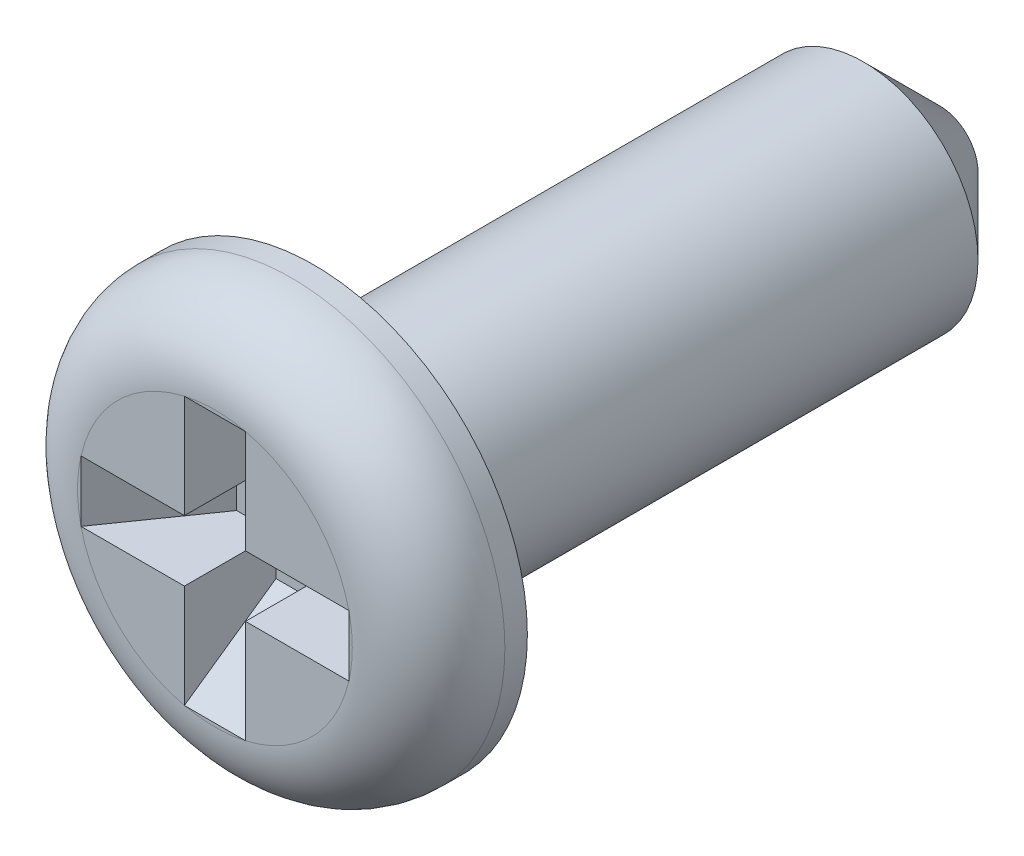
from build123d import *

# Parameters (mm, degrees)
ESQUISSE3_R             = 1.5
EXTRUSION1_DEPTH        = 9.5
ENL_V_MAT_EXTRU_2_DEPTH = 1.2
D_POUILLE3_ANGLE        = 35
CHANFREIN1_SIZE         = 1


with BuildPart() as part:
    # Esquisse1 → R_volution2 (revolve)
    with BuildSketch(Plane(origin=(0, 0, 0), x_dir=(0, 0, -1), z_dir=(1, 0, 0)), mode=Mode.PRIVATE) as r_volution2_sk:
        with BuildLine():
            Line((1.294657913, 2.8), (1, 2.8))
            ThreePointArc((1, 2.8), (0.292893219, 2.507106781), (0, 1.8))
            Line((0, 1.8), (0, 0))
            Line((0, 0), (1.294657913, 0))
            Line((1.294657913, 0), (1.294657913, 2.8))
        make_face()
    revolve(r_volution2_sk.sketch.rotate(Axis((0, 0, 1.603508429), (0, 0, -1)), 90), axis=Axis((0, 0, 1.603508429), (0, 0, -1)))

    # Esquisse3 → Extrusion1 (add)
    with BuildSketch(Plane.XY):
        Circle(ESQUISSE3_R)
    extrude(amount=-EXTRUSION1_DEPTH)

    # Esquisse2 → Enl_v. mat.-Extru.2 (cut)
    with BuildSketch(Plane.XY):
        Polygon((0.4, -0.4), (1.754992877, -0.4), (1.754992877, 0.4), (0.4, 0.4), (0.4, 1.754992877), (-0.4, 1.754992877), (-0.4, 0.4), (-1.754992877, 0.4), (-1.754992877, -0.4), (-0.4, -0.4), (-0.4, -1.754992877), (0.4, -1.754992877), align=None)
    extrude(amount=-ENL_V_MAT_EXTRU_2_DEPTH, mode=Mode.SUBTRACT)

    # D_pouille3
    d_pouille3_faces = [part.faces().sort_by_distance(p)[0] for p in [
        (-1.754992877, 0, -0.6),
        (1.754992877, 0, -0.6),
        (0, 1.754992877, -0.6),
        (0, -1.754992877, -0.6),
    ]]
    draft(d_pouille3_faces, Plane(origin=(0, 1.8, 0), x_dir=(1, 0, 0), z_dir=(0, 0, 1)), D_POUILLE3_ANGLE)

    # Chanfrein1
    chanfrein1_edges = [part.edges().sort_by_distance(p)[0] for p in [
        (-1.5, 0, -9.5),
    ]]
    chamfer(chanfrein1_edges, length=CHANFREIN1_SIZE)


solid = part.part
